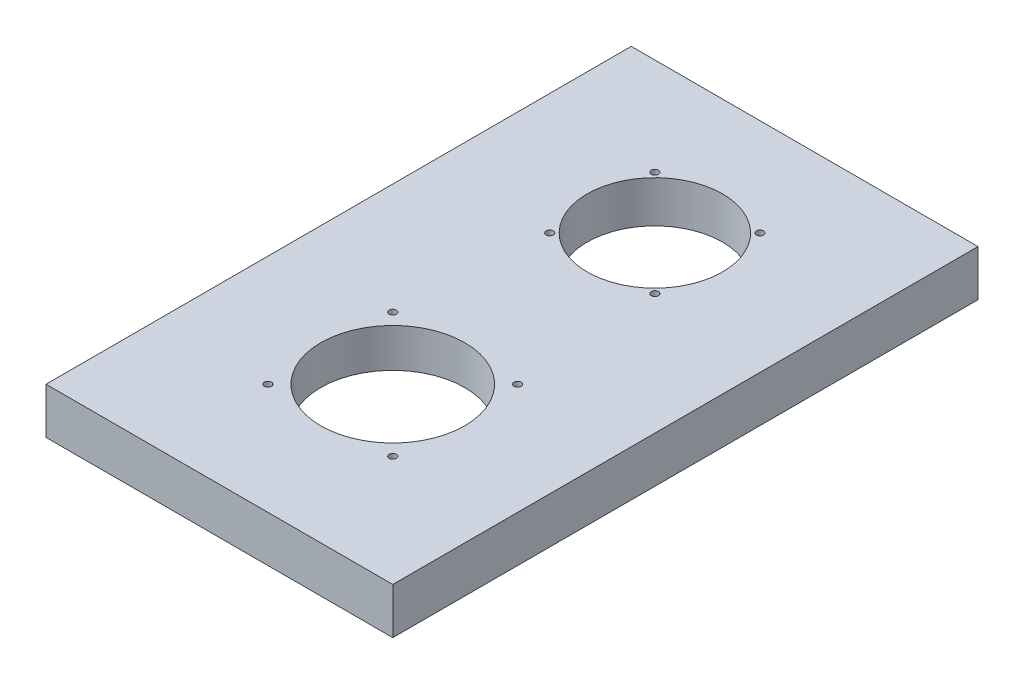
from build123d import *

# Parameters (mm, degrees)
SKETCH1_W           = 120.4
SKETCH1_H           = 203.2
BOSS_EXTRUDE1_DEPTH = 16
SKETCH2_R           = 23.5
CUT_EXTRUDE1_DEPTH  = 120.174661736
SKETCH3_R           = 33
CUT_EXTRUDE2_DEPTH  = 1.5
SKETCH4_R           = 1.25
CUT_EXTRUDE3_DEPTH  = 119.982561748
SKETCH5_R           = 25
SKETCH5_R_2         = 1.25
CUT_EXTRUDE4_DEPTH  = 120.174661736
SKETCH6_R           = 38
CUT_EXTRUDE5_DEPTH  = 2.5


with BuildPart() as part:
    # Sketch1 → Boss-Extrude1 (new body)
    with BuildSketch(Plane(origin=(0, 0, 0), x_dir=(1, 0, 0), z_dir=(0, 1, 0))):
        Rectangle(SKETCH1_W, SKETCH1_H)
    extrude(amount=BOSS_EXTRUDE1_DEPTH)

    # Sketch2 → Cut-Extrude1 (cut, through all)
    with BuildSketch(Plane.XZ):
        with Locations(Location((0, -49.6, 0), (0, 0, 270))):
            Circle(SKETCH2_R)
    extrude(amount=-CUT_EXTRUDE1_DEPTH, mode=Mode.SUBTRACT)

    # Sketch3 → Cut-Extrude2 (cut)
    with BuildSketch(Plane.XZ):
        with Locations(Location((0, -49.6, 0), (0, 0, 270))):
            Circle(SKETCH3_R)
    extrude(amount=-CUT_EXTRUDE2_DEPTH, mode=Mode.SUBTRACT)

    # Sketch4 → Cut-Extrude3 (cut, through all)
    with BuildSketch(Plane.XZ.offset(-1.5)):
        with Locations(Location((-18.243354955, -31.356645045, 0), (0, 0, 270))):
            Circle(SKETCH4_R)
        with Locations(Location((-18.243354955, -67.843354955, 0), (0, 0, 270))):
            Circle(SKETCH4_R)
        with Locations(Location((18.243354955, -67.843354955, 0), (0, 0, 270))):
            Circle(SKETCH4_R)
        with Locations(Location((18.243354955, -31.356645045, 0), (0, 0, 270))):
            Circle(SKETCH4_R)
    extrude(amount=-CUT_EXTRUDE3_DEPTH, mode=Mode.SUBTRACT)

    # Sketch5 → Cut-Extrude4 (cut, through all)
    with BuildSketch(Plane.XZ):
        with Locations(Location((0, 41.4, 0), (0, 0, 270))):
            Circle(SKETCH5_R)
        with Locations(Location((-21.672822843, 63.072822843, 0), (0, 0, 270))):
            Circle(SKETCH5_R_2)
        with Locations(Location((-21.672822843, 19.727177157, 0), (0, 0, 270))):
            Circle(SKETCH5_R_2)
        with Locations(Location((21.672822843, 19.727177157, 0), (0, 0, 90))):
            Circle(SKETCH5_R_2)
        with Locations(Location((21.672822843, 63.072822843, 0), (0, 0, 90))):
            Circle(SKETCH5_R_2)
    extrude(amount=-CUT_EXTRUDE4_DEPTH, mode=Mode.SUBTRACT)

    # Sketch6 → Cut-Extrude5 (cut)
    with BuildSketch(Plane.XZ):
        with Locations(Location((0, 41.4, 0), (0, 0, 270))):
            Circle(SKETCH6_R)
    extrude(amount=-CUT_EXTRUDE5_DEPTH, mode=Mode.SUBTRACT)


solid = part.part
